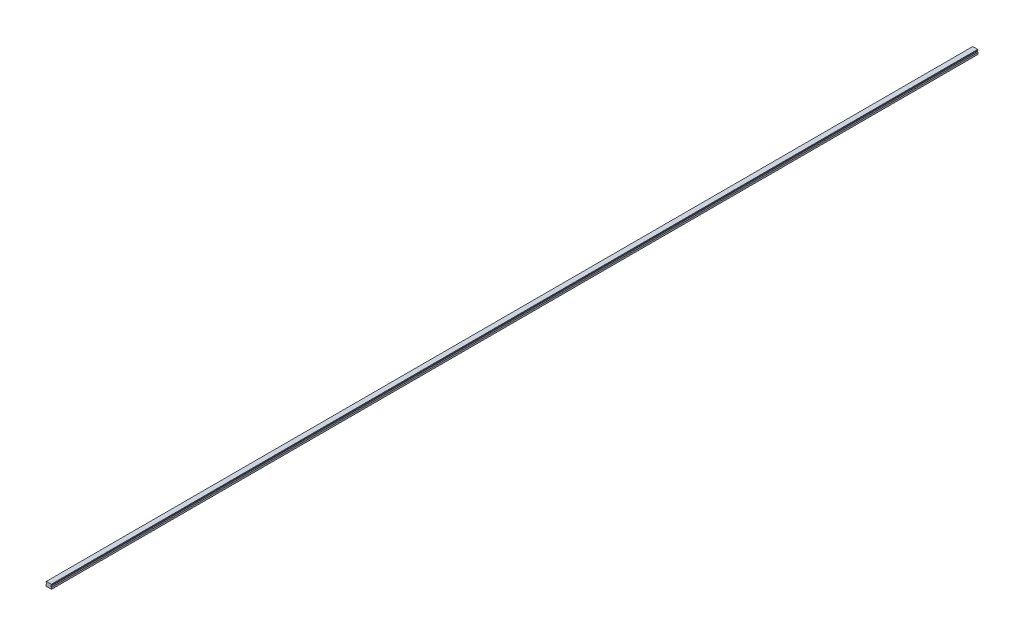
from build123d import *

# Parameters (mm, degrees)
SKETCH1_W           = 20
SKETCH1_H           = 16.3
BOSS_EXTRUDE1_DEPTH = 1670
CUT_EXTRUDE1_DEPTH  = 3341.054743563
CHAMFER1_SIZE       = 1
FILLET1_R           = 1
CUT_EXTRUDE2_DEPTH  = 3341.054743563
SKETCH5_R           = 3
SKETCH5_R_2         = 2.5
CUT_EXTRUDE5_DEPTH  = 10
SKETCH5_2_R         = 2.5
CUT_EXTRUDE6_DEPTH  = 13
LPATTERN2_COUNT     = 56
LPATTERN2_PITCH     = 60


with BuildPart() as part:
    # Sketch1 → Boss-Extrude1 (new, symmetric)
    with BuildSketch(Plane.XY):
        with Locations((0, 8.15)):
            Rectangle(SKETCH1_W, SKETCH1_H)
    extrude(amount=BOSS_EXTRUDE1_DEPTH, both=True)

    # Sketch2 → Cut-Extrude1 (cut, through all)
    with BuildSketch(Plane.XY.offset(1670)):
        Polygon((-10, 14.3), (-10, 7.3), (-7.666666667, 9.633333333), (-7.666666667, 11.966666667), align=None)
        Polygon((7.666666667, 11.966666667), (10, 14.3), (10, 7.3), (7.666666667, 9.633333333), align=None)
    extrude(amount=-CUT_EXTRUDE1_DEPTH, mode=Mode.SUBTRACT)

    # Chamfer1
    chamfer1_edges = [part.edges().sort_by_distance(p)[0] for p in [
        (-10, 16.3, 0),
        (10, 16.3, 0),
        (10, 0, 0),
        (-10, 0, 0),
    ]]
    chamfer(chamfer1_edges, length=CHAMFER1_SIZE)

    # Fillet1
    fillet1_edges = [part.edges().sort_by_distance(p)[0] for p in [
        (-7.666666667, 11.966666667, 0),
        (-7.666666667, 9.633333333, 0),
        (7.666666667, 9.633333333, 0),
        (7.666666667, 11.966666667, 0),
    ]]
    fillet(fillet1_edges, radius=FILLET1_R)

    # Sketch3 → Cut-Extrude2 (cut, through all)
    with BuildSketch(Plane.XY.offset(1670)):
        Polygon((-6, 0), (-5, 1), (5, 1), (6, 0), align=None)
    extrude(amount=-CUT_EXTRUDE2_DEPTH, mode=Mode.SUBTRACT)

    # Sketch5 → Cut-Extrude5 (cut)
    with BuildSketch(Plane.XZ.offset(-1)):
        with Locations(Location((0, 1650, 0), (0, 0, 270))):
            Circle(SKETCH5_R)
        with Locations(Location((0, 1650, 0), (0, 0, 270))):
            Circle(SKETCH5_R_2, mode=Mode.SUBTRACT)
    cut_extrude5 = extrude(amount=-CUT_EXTRUDE5_DEPTH, mode=Mode.SUBTRACT)

    # Sketch5_2 → Cut-Extrude6 (cut)
    with BuildSketch(Plane.XZ.offset(-1)):
        with Locations(Location((0, 1650, 0), (0, 0, 270))):
            Circle(SKETCH5_2_R)
    cut_extrude6 = extrude(amount=-CUT_EXTRUDE6_DEPTH, mode=Mode.SUBTRACT)

    # Cut-Extrude7 cone 1 section (on through the dimple's axis) → Cut-Extrude7 (revolve, cut)
    with BuildSketch(Plane(origin=(0, 14, 1650), x_dir=(0, 0, -1), z_dir=(1, 0, 0))):
        Polygon((0, 0), (2.5, 0), (0, 1.443375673), align=None)
    cut_extrude7 = revolve(axis=Axis((0, 14, 1650), (0, 1, 0)), mode=Mode.SUBTRACT)

    # LPattern2: Cut-Extrude5, Cut-Extrude6, Cut-Extrude7 ×56
    with Locations(*[(0, 0, -i * LPATTERN2_PITCH) for i in range(1, LPATTERN2_COUNT)]):
        add(cut_extrude5, mode=Mode.SUBTRACT)
        add(cut_extrude6, mode=Mode.SUBTRACT)
        add(cut_extrude7, mode=Mode.SUBTRACT)


solid = part.part
